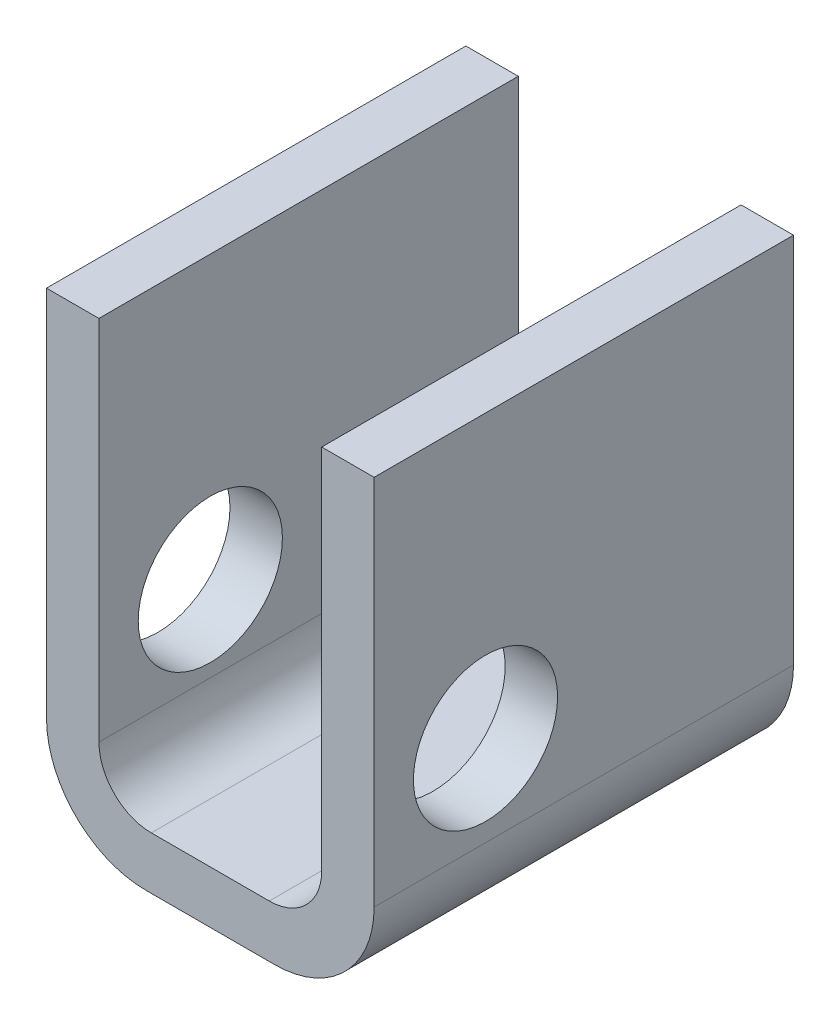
ISO-10303-21;
HEADER;
FILE_DESCRIPTION(('STEP AP214'),'2;1');
FILE_NAME('part.step','',(''),(''),'','','');
FILE_SCHEMA(('AUTOMOTIVE_DESIGN { 1 0 10303 214 1 1 1 1 }'));
ENDSEC;
DATA;
#1=APPLICATION_CONTEXT('core data for automotive mechanical design processes');
#2=APPLICATION_PROTOCOL_DEFINITION('international standard','automotive_design',2000,#1);
#3=PRODUCT_CONTEXT('',#1,'mechanical');
#4=PRODUCT('Part','Part','',(#3));
#5=PRODUCT_RELATED_PRODUCT_CATEGORY('part','',(#4));
#6=PRODUCT_DEFINITION_FORMATION('','',#4);
#7=PRODUCT_DEFINITION_CONTEXT('part definition',#1,'design');
#8=PRODUCT_DEFINITION('design','',#6,#7);
#9=PRODUCT_DEFINITION_SHAPE('','',#8);
#10=(LENGTH_UNIT() NAMED_UNIT(*) SI_UNIT(.MILLI.,.METRE.));
#11=(NAMED_UNIT(*) PLANE_ANGLE_UNIT() SI_UNIT($,.RADIAN.));
#12=(NAMED_UNIT(*) SI_UNIT($,.STERADIAN.) SOLID_ANGLE_UNIT());
#13=UNCERTAINTY_MEASURE_WITH_UNIT(LENGTH_MEASURE(1.E-05),#10,'distance_accuracy_value','');
#14=(GEOMETRIC_REPRESENTATION_CONTEXT(3) GLOBAL_UNCERTAINTY_ASSIGNED_CONTEXT((#13)) GLOBAL_UNIT_ASSIGNED_CONTEXT((#10,
#11,#12)) REPRESENTATION_CONTEXT('',''));
#15=CARTESIAN_POINT('',(0.,0.,0.));
#16=DIRECTION('',(0.,0.,1.));
#17=DIRECTION('',(1.,0.,0.));
#18=AXIS2_PLACEMENT_3D('',#15,#16,#17);
#19=CARTESIAN_POINT('',(238.514744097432,153.970613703,50.8));
#20=DIRECTION('',(0.,-1.,0.));
#21=DIRECTION('',(0.,0.,-1.));
#22=AXIS2_PLACEMENT_3D('',#19,#20,#21);
#23=PLANE('',#22);
#24=DIRECTION('',(-1.,0.,0.));
#25=VECTOR('',#24,1.);
#26=CARTESIAN_POINT('',(238.514744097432,153.970613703,0.));
#27=LINE('',#26,#25);
#28=CARTESIAN_POINT('',(244.864744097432,153.970613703,0.));
#29=VERTEX_POINT('',#28);
#30=CARTESIAN_POINT('',(238.514744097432,153.970613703,0.));
#31=VERTEX_POINT('',#30);
#32=EDGE_CURVE('E154',#29,#31,#27,.T.);
#33=ORIENTED_EDGE('',*,*,#32,.T.);
#34=DIRECTION('',(0.,0.,-1.));
#35=VECTOR('',#34,1.);
#36=CARTESIAN_POINT('',(238.514744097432,153.970613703,50.8));
#37=LINE('',#36,#35);
#38=CARTESIAN_POINT('',(238.514744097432,153.970613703,50.8));
#39=VERTEX_POINT('',#38);
#40=EDGE_CURVE('E11',#39,#31,#37,.T.);
#41=ORIENTED_EDGE('',*,*,#40,.F.);
#42=DIRECTION('',(-1.,0.,0.));
#43=VECTOR('',#42,1.);
#44=CARTESIAN_POINT('',(238.514744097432,153.970613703,50.8));
#45=LINE('',#44,#43);
#46=CARTESIAN_POINT('',(244.864744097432,153.970613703,50.8));
#47=VERTEX_POINT('',#46);
#48=EDGE_CURVE('E177',#47,#39,#45,.T.);
#49=ORIENTED_EDGE('',*,*,#48,.F.);
#50=DIRECTION('',(0.,0.,-1.));
#51=VECTOR('',#50,1.);
#52=CARTESIAN_POINT('',(244.864744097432,153.970613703,50.8));
#53=LINE('',#52,#51);
#54=EDGE_CURVE('E150',#47,#29,#53,.T.);
#55=ORIENTED_EDGE('',*,*,#54,.T.);
#56=EDGE_LOOP('',(#33,#41,#49,#55));
#57=FACE_BOUND('',#56,.T.);
#58=ADVANCED_FACE('F34',(#57),#23,.F.);
#59=CARTESIAN_POINT('',(238.514744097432,109.520613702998,50.8));
#60=DIRECTION('',(1.,0.,0.));
#61=DIRECTION('',(0.,0.,-1.));
#62=AXIS2_PLACEMENT_3D('',#59,#60,#61);
#63=PLANE('',#62);
#64=CARTESIAN_POINT('',(238.514744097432,119.839363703,37.30625));
#65=DIRECTION('',(1.,0.,0.));
#66=DIRECTION('',(0.,0.,-1.));
#67=AXIS2_PLACEMENT_3D('',#64,#65,#66);
#68=CIRCLE('',#67,8.73125);
#69=CARTESIAN_POINT('',(238.514744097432,119.839363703,28.575));
#70=VERTEX_POINT('',#69);
#71=EDGE_CURVE('E158',#70,#70,#68,.T.);
#72=ORIENTED_EDGE('',*,*,#71,.T.);
#73=EDGE_LOOP('',(#72));
#74=FACE_BOUND('',#73,.T.);
#75=DIRECTION('',(0.,-1.,0.));
#76=VECTOR('',#75,1.);
#77=CARTESIAN_POINT('',(238.514744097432,109.520613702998,0.));
#78=LINE('',#77,#76);
#79=CARTESIAN_POINT('',(238.514744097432,109.520613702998,0.));
#80=VERTEX_POINT('',#79);
#81=EDGE_CURVE('E157',#31,#80,#78,.T.);
#82=ORIENTED_EDGE('',*,*,#81,.T.);
#83=DIRECTION('',(0.,0.,-1.));
#84=VECTOR('',#83,1.);
#85=CARTESIAN_POINT('',(238.514744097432,109.520613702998,50.8));
#86=LINE('',#85,#84);
#87=CARTESIAN_POINT('',(238.514744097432,109.520613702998,50.8));
#88=VERTEX_POINT('',#87);
#89=EDGE_CURVE('E42',#88,#80,#86,.T.);
#90=ORIENTED_EDGE('',*,*,#89,.F.);
#91=DIRECTION('',(0.,-1.,0.));
#92=VECTOR('',#91,1.);
#93=CARTESIAN_POINT('',(238.514744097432,109.520613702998,50.8));
#94=LINE('',#93,#92);
#95=EDGE_CURVE('E105',#39,#88,#94,.T.);
#96=ORIENTED_EDGE('',*,*,#95,.F.);
#97=ORIENTED_EDGE('',*,*,#40,.T.);
#98=EDGE_LOOP('',(#82,#90,#96,#97));
#99=FACE_BOUND('',#98,.T.);
#100=ADVANCED_FACE('F257',(#74,#99),#63,.F.);
#101=CARTESIAN_POINT('',(232.164744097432,109.520613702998,50.8));
#102=DIRECTION('',(0.,0.,-1.));
#103=DIRECTION('',(-1.,0.,0.));
#104=AXIS2_PLACEMENT_3D('',#101,#102,#103);
#105=CYLINDRICAL_SURFACE('',#104,6.34999999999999);
#106=CARTESIAN_POINT('',(232.164744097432,109.520613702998,0.));
#107=DIRECTION('',(0.,0.,-1.));
#108=DIRECTION('',(1.,0.,0.));
#109=AXIS2_PLACEMENT_3D('',#106,#107,#108);
#110=CIRCLE('',#109,6.34999999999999);
#111=CARTESIAN_POINT('',(232.164744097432,103.170613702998,0.));
#112=VERTEX_POINT('',#111);
#113=EDGE_CURVE('E160',#80,#112,#110,.T.);
#114=ORIENTED_EDGE('',*,*,#113,.T.);
#115=DIRECTION('',(0.,0.,-1.));
#116=VECTOR('',#115,1.);
#117=CARTESIAN_POINT('',(232.164744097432,103.170613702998,50.8));
#118=LINE('',#117,#116);
#119=CARTESIAN_POINT('',(232.164744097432,103.170613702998,50.8));
#120=VERTEX_POINT('',#119);
#121=EDGE_CURVE('E196',#120,#112,#118,.T.);
#122=ORIENTED_EDGE('',*,*,#121,.F.);
#123=CARTESIAN_POINT('',(232.164744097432,109.520613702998,50.8));
#124=DIRECTION('',(0.,0.,-1.));
#125=DIRECTION('',(1.,0.,0.));
#126=AXIS2_PLACEMENT_3D('',#123,#124,#125);
#127=CIRCLE('',#126,6.34999999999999);
#128=EDGE_CURVE('E204',#88,#120,#127,.T.);
#129=ORIENTED_EDGE('',*,*,#128,.F.);
#130=ORIENTED_EDGE('',*,*,#89,.T.);
#131=EDGE_LOOP('',(#114,#122,#129,#130));
#132=FACE_BOUND('',#131,.T.);
#133=ADVANCED_FACE('F202',(#132),#105,.F.);
#134=CARTESIAN_POINT('',(217.877244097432,103.170613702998,50.8));
#135=DIRECTION('',(0.,-1.,0.));
#136=DIRECTION('',(0.,0.,-1.));
#137=AXIS2_PLACEMENT_3D('',#134,#135,#136);
#138=PLANE('',#137);
#139=DIRECTION('',(-1.,0.,0.));
#140=VECTOR('',#139,1.);
#141=CARTESIAN_POINT('',(217.877244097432,103.170613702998,0.));
#142=LINE('',#141,#140);
#143=CARTESIAN_POINT('',(217.877244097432,103.170613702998,0.));
#144=VERTEX_POINT('',#143);
#145=EDGE_CURVE('E162',#112,#144,#142,.T.);
#146=ORIENTED_EDGE('',*,*,#145,.T.);
#147=DIRECTION('',(0.,0.,-1.));
#148=VECTOR('',#147,1.);
#149=CARTESIAN_POINT('',(217.877244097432,103.170613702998,50.8));
#150=LINE('',#149,#148);
#151=CARTESIAN_POINT('',(217.877244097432,103.170613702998,50.8));
#152=VERTEX_POINT('',#151);
#153=EDGE_CURVE('E193',#152,#144,#150,.T.);
#154=ORIENTED_EDGE('',*,*,#153,.F.);
#155=DIRECTION('',(-1.,0.,0.));
#156=VECTOR('',#155,1.);
#157=CARTESIAN_POINT('',(217.877244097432,103.170613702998,50.8));
#158=LINE('',#157,#156);
#159=EDGE_CURVE('E222',#120,#152,#158,.T.);
#160=ORIENTED_EDGE('',*,*,#159,.F.);
#161=ORIENTED_EDGE('',*,*,#121,.T.);
#162=EDGE_LOOP('',(#146,#154,#160,#161));
#163=FACE_BOUND('',#162,.T.);
#164=ADVANCED_FACE('F213',(#163),#138,.F.);
#165=CARTESIAN_POINT('',(217.877244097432,109.520613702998,50.8));
#166=DIRECTION('',(0.,0.,-1.));
#167=DIRECTION('',(-1.,0.,0.));
#168=AXIS2_PLACEMENT_3D('',#165,#166,#167);
#169=CYLINDRICAL_SURFACE('',#168,6.34999999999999);
#170=CARTESIAN_POINT('',(217.877244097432,109.520613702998,0.));
#171=DIRECTION('',(0.,0.,-1.));
#172=DIRECTION('',(-1.,0.,0.));
#173=AXIS2_PLACEMENT_3D('',#170,#171,#172);
#174=CIRCLE('',#173,6.34999999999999);
#175=CARTESIAN_POINT('',(211.527244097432,109.520613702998,0.));
#176=VERTEX_POINT('',#175);
#177=EDGE_CURVE('E164',#144,#176,#174,.T.);
#178=ORIENTED_EDGE('',*,*,#177,.T.);
#179=DIRECTION('',(0.,0.,-1.));
#180=VECTOR('',#179,1.);
#181=CARTESIAN_POINT('',(211.527244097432,109.520613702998,50.8));
#182=LINE('',#181,#180);
#183=CARTESIAN_POINT('',(211.527244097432,109.520613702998,50.8));
#184=VERTEX_POINT('',#183);
#185=EDGE_CURVE('E190',#184,#176,#182,.T.);
#186=ORIENTED_EDGE('',*,*,#185,.F.);
#187=CARTESIAN_POINT('',(217.877244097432,109.520613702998,50.8));
#188=DIRECTION('',(0.,0.,-1.));
#189=DIRECTION('',(-1.,0.,0.));
#190=AXIS2_PLACEMENT_3D('',#187,#188,#189);
#191=CIRCLE('',#190,6.34999999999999);
#192=EDGE_CURVE('E219',#152,#184,#191,.T.);
#193=ORIENTED_EDGE('',*,*,#192,.F.);
#194=ORIENTED_EDGE('',*,*,#153,.T.);
#195=EDGE_LOOP('',(#178,#186,#193,#194));
#196=FACE_BOUND('',#195,.T.);
#197=ADVANCED_FACE('F217',(#196),#169,.F.);
#198=CARTESIAN_POINT('',(211.527244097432,153.970613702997,50.8));
#199=DIRECTION('',(-1.,0.,0.));
#200=DIRECTION('',(0.,0.,1.));
#201=AXIS2_PLACEMENT_3D('',#198,#199,#200);
#202=PLANE('',#201);
#203=CARTESIAN_POINT('',(211.527244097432,119.839363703,37.30625));
#204=DIRECTION('',(-1.,0.,0.));
#205=DIRECTION('',(0.,0.,1.));
#206=AXIS2_PLACEMENT_3D('',#203,#204,#205);
#207=CIRCLE('',#206,8.73125);
#208=CARTESIAN_POINT('',(211.527244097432,119.839363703,46.0375));
#209=VERTEX_POINT('',#208);
#210=EDGE_CURVE('E361',#209,#209,#207,.T.);
#211=ORIENTED_EDGE('',*,*,#210,.T.);
#212=EDGE_LOOP('',(#211));
#213=FACE_BOUND('',#212,.T.);
#214=DIRECTION('',(0.,1.,0.));
#215=VECTOR('',#214,1.);
#216=CARTESIAN_POINT('',(211.527244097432,153.970613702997,0.));
#217=LINE('',#216,#215);
#218=CARTESIAN_POINT('',(211.527244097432,153.970613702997,0.));
#219=VERTEX_POINT('',#218);
#220=EDGE_CURVE('E166',#176,#219,#217,.T.);
#221=ORIENTED_EDGE('',*,*,#220,.T.);
#222=DIRECTION('',(0.,0.,-1.));
#223=VECTOR('',#222,1.);
#224=CARTESIAN_POINT('',(211.527244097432,153.970613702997,50.8));
#225=LINE('',#224,#223);
#226=CARTESIAN_POINT('',(211.527244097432,153.970613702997,50.8));
#227=VERTEX_POINT('',#226);
#228=EDGE_CURVE('E187',#227,#219,#225,.T.);
#229=ORIENTED_EDGE('',*,*,#228,.F.);
#230=DIRECTION('',(0.,1.,0.));
#231=VECTOR('',#230,1.);
#232=CARTESIAN_POINT('',(211.527244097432,153.970613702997,50.8));
#233=LINE('',#232,#231);
#234=EDGE_CURVE('E221',#184,#227,#233,.T.);
#235=ORIENTED_EDGE('',*,*,#234,.F.);
#236=ORIENTED_EDGE('',*,*,#185,.T.);
#237=EDGE_LOOP('',(#221,#229,#235,#236));
#238=FACE_BOUND('',#237,.T.);
#239=ADVANCED_FACE('F272',(#213,#238),#202,.F.);
#240=CARTESIAN_POINT('',(205.177244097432,153.970613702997,50.8));
#241=DIRECTION('',(0.,-1.,0.));
#242=DIRECTION('',(0.,0.,-1.));
#243=AXIS2_PLACEMENT_3D('',#240,#241,#242);
#244=PLANE('',#243);
#245=DIRECTION('',(-1.,0.,0.));
#246=VECTOR('',#245,1.);
#247=CARTESIAN_POINT('',(205.177244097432,153.970613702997,0.));
#248=LINE('',#247,#246);
#249=CARTESIAN_POINT('',(205.177244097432,153.970613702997,0.));
#250=VERTEX_POINT('',#249);
#251=EDGE_CURVE('E168',#219,#250,#248,.T.);
#252=ORIENTED_EDGE('',*,*,#251,.T.);
#253=DIRECTION('',(0.,0.,-1.));
#254=VECTOR('',#253,1.);
#255=CARTESIAN_POINT('',(205.177244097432,153.970613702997,50.8));
#256=LINE('',#255,#254);
#257=CARTESIAN_POINT('',(205.177244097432,153.970613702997,50.8));
#258=VERTEX_POINT('',#257);
#259=EDGE_CURVE('E184',#258,#250,#256,.T.);
#260=ORIENTED_EDGE('',*,*,#259,.F.);
#261=DIRECTION('',(-1.,0.,0.));
#262=VECTOR('',#261,1.);
#263=CARTESIAN_POINT('',(205.177244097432,153.970613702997,50.8));
#264=LINE('',#263,#262);
#265=EDGE_CURVE('E224',#227,#258,#264,.T.);
#266=ORIENTED_EDGE('',*,*,#265,.F.);
#267=ORIENTED_EDGE('',*,*,#228,.T.);
#268=EDGE_LOOP('',(#252,#260,#266,#267));
#269=FACE_BOUND('',#268,.T.);
#270=ADVANCED_FACE('F275',(#269),#244,.F.);
#271=CARTESIAN_POINT('',(205.177244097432,108.888153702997,50.8));
#272=DIRECTION('',(1.,0.,0.));
#273=DIRECTION('',(0.,0.,-1.));
#274=AXIS2_PLACEMENT_3D('',#271,#272,#273);
#275=PLANE('',#274);
#276=CARTESIAN_POINT('',(205.177244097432,119.839363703,37.30625));
#277=DIRECTION('',(1.,0.,0.));
#278=DIRECTION('',(0.,0.,-1.));
#279=AXIS2_PLACEMENT_3D('',#276,#277,#278);
#280=CIRCLE('',#279,8.73125);
#281=CARTESIAN_POINT('',(205.177244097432,119.839363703,28.575));
#282=VERTEX_POINT('',#281);
#283=EDGE_CURVE('E358',#282,#282,#280,.T.);
#284=ORIENTED_EDGE('',*,*,#283,.T.);
#285=EDGE_LOOP('',(#284));
#286=FACE_BOUND('',#285,.T.);
#287=DIRECTION('',(0.,-1.,0.));
#288=VECTOR('',#287,1.);
#289=CARTESIAN_POINT('',(205.177244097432,108.888153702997,0.));
#290=LINE('',#289,#288);
#291=CARTESIAN_POINT('',(205.177244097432,108.888153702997,0.));
#292=VERTEX_POINT('',#291);
#293=EDGE_CURVE('E170',#250,#292,#290,.T.);
#294=ORIENTED_EDGE('',*,*,#293,.T.);
#295=DIRECTION('',(0.,0.,-1.));
#296=VECTOR('',#295,1.);
#297=CARTESIAN_POINT('',(205.177244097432,108.888153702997,50.8));
#298=LINE('',#297,#296);
#299=CARTESIAN_POINT('',(205.177244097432,108.888153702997,50.8));
#300=VERTEX_POINT('',#299);
#301=EDGE_CURVE('E181',#300,#292,#298,.T.);
#302=ORIENTED_EDGE('',*,*,#301,.F.);
#303=DIRECTION('',(0.,-1.,0.));
#304=VECTOR('',#303,1.);
#305=CARTESIAN_POINT('',(205.177244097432,108.888153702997,50.8));
#306=LINE('',#305,#304);
#307=EDGE_CURVE('E230',#258,#300,#306,.T.);
#308=ORIENTED_EDGE('',*,*,#307,.F.);
#309=ORIENTED_EDGE('',*,*,#259,.T.);
#310=EDGE_LOOP('',(#294,#302,#308,#309));
#311=FACE_BOUND('',#310,.T.);
#312=ADVANCED_FACE('F236',(#286,#311),#275,.F.);
#313=CARTESIAN_POINT('',(217.244784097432,108.888153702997,50.8));
#314=DIRECTION('',(0.,0.,-1.));
#315=DIRECTION('',(-1.,0.,0.));
#316=AXIS2_PLACEMENT_3D('',#313,#314,#315);
#317=CYLINDRICAL_SURFACE('',#316,12.06754);
#318=CARTESIAN_POINT('',(217.244784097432,108.888153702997,0.));
#319=DIRECTION('',(0.,0.,1.));
#320=DIRECTION('',(-1.,0.,0.));
#321=AXIS2_PLACEMENT_3D('',#318,#319,#320);
#322=CIRCLE('',#321,12.06754);
#323=CARTESIAN_POINT('',(217.244784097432,96.8206137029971,0.));
#324=VERTEX_POINT('',#323);
#325=EDGE_CURVE('E172',#292,#324,#322,.T.);
#326=ORIENTED_EDGE('',*,*,#325,.T.);
#327=DIRECTION('',(0.,0.,-1.));
#328=VECTOR('',#327,1.);
#329=CARTESIAN_POINT('',(217.244784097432,96.8206137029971,50.8));
#330=LINE('',#329,#328);
#331=CARTESIAN_POINT('',(217.244784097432,96.8206137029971,50.8));
#332=VERTEX_POINT('',#331);
#333=EDGE_CURVE('E145',#332,#324,#330,.T.);
#334=ORIENTED_EDGE('',*,*,#333,.F.);
#335=CARTESIAN_POINT('',(217.244784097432,108.888153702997,50.8));
#336=DIRECTION('',(0.,0.,1.));
#337=DIRECTION('',(-1.,0.,0.));
#338=AXIS2_PLACEMENT_3D('',#335,#336,#337);
#339=CIRCLE('',#338,12.06754);
#340=EDGE_CURVE('E136',#300,#332,#339,.T.);
#341=ORIENTED_EDGE('',*,*,#340,.F.);
#342=ORIENTED_EDGE('',*,*,#301,.T.);
#343=EDGE_LOOP('',(#326,#334,#341,#342));
#344=FACE_BOUND('',#343,.T.);
#345=ADVANCED_FACE('F240',(#344),#317,.T.);
#346=CARTESIAN_POINT('',(217.244784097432,96.8206137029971,50.8));
#347=DIRECTION('',(0.,1.,0.));
#348=DIRECTION('',(0.,0.,1.));
#349=AXIS2_PLACEMENT_3D('',#346,#347,#348);
#350=PLANE('',#349);
#351=DIRECTION('',(1.,0.,0.));
#352=VECTOR('',#351,1.);
#353=CARTESIAN_POINT('',(217.244784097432,96.8206137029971,0.));
#354=LINE('',#353,#352);
#355=CARTESIAN_POINT('',(232.797204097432,96.8206137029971,0.));
#356=VERTEX_POINT('',#355);
#357=EDGE_CURVE('E144',#324,#356,#354,.T.);
#358=ORIENTED_EDGE('',*,*,#357,.T.);
#359=DIRECTION('',(0.,0.,-1.));
#360=VECTOR('',#359,1.);
#361=CARTESIAN_POINT('',(232.797204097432,96.8206137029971,50.8));
#362=LINE('',#361,#360);
#363=CARTESIAN_POINT('',(232.797204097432,96.8206137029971,50.8));
#364=VERTEX_POINT('',#363);
#365=EDGE_CURVE('E141',#364,#356,#362,.T.);
#366=ORIENTED_EDGE('',*,*,#365,.F.);
#367=DIRECTION('',(1.,0.,0.));
#368=VECTOR('',#367,1.);
#369=CARTESIAN_POINT('',(217.244784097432,96.8206137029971,50.8));
#370=LINE('',#369,#368);
#371=EDGE_CURVE('E130',#332,#364,#370,.T.);
#372=ORIENTED_EDGE('',*,*,#371,.F.);
#373=ORIENTED_EDGE('',*,*,#333,.T.);
#374=EDGE_LOOP('',(#358,#366,#372,#373));
#375=FACE_BOUND('',#374,.T.);
#376=ADVANCED_FACE('F142',(#375),#350,.F.);
#377=CARTESIAN_POINT('',(232.797204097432,108.888153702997,50.8));
#378=DIRECTION('',(0.,0.,-1.));
#379=DIRECTION('',(-1.,0.,0.));
#380=AXIS2_PLACEMENT_3D('',#377,#378,#379);
#381=CYLINDRICAL_SURFACE('',#380,12.06754);
#382=CARTESIAN_POINT('',(232.797204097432,108.888153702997,0.));
#383=DIRECTION('',(0.,0.,1.));
#384=DIRECTION('',(1.,0.,0.));
#385=AXIS2_PLACEMENT_3D('',#382,#383,#384);
#386=CIRCLE('',#385,12.06754);
#387=CARTESIAN_POINT('',(244.864744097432,108.888153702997,0.));
#388=VERTEX_POINT('',#387);
#389=EDGE_CURVE('E91',#356,#388,#386,.T.);
#390=ORIENTED_EDGE('',*,*,#389,.T.);
#391=DIRECTION('',(0.,0.,-1.));
#392=VECTOR('',#391,1.);
#393=CARTESIAN_POINT('',(244.864744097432,108.888153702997,50.8));
#394=LINE('',#393,#392);
#395=CARTESIAN_POINT('',(244.864744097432,108.888153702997,50.8));
#396=VERTEX_POINT('',#395);
#397=EDGE_CURVE('E146',#396,#388,#394,.T.);
#398=ORIENTED_EDGE('',*,*,#397,.F.);
#399=CARTESIAN_POINT('',(232.797204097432,108.888153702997,50.8));
#400=DIRECTION('',(0.,0.,1.));
#401=DIRECTION('',(1.,0.,0.));
#402=AXIS2_PLACEMENT_3D('',#399,#400,#401);
#403=CIRCLE('',#402,12.06754);
#404=EDGE_CURVE('E134',#364,#396,#403,.T.);
#405=ORIENTED_EDGE('',*,*,#404,.F.);
#406=ORIENTED_EDGE('',*,*,#365,.T.);
#407=EDGE_LOOP('',(#390,#398,#405,#406));
#408=FACE_BOUND('',#407,.T.);
#409=ADVANCED_FACE('F148',(#408),#381,.T.);
#410=CARTESIAN_POINT('',(244.864744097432,108.888153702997,50.8));
#411=DIRECTION('',(-1.,0.,0.));
#412=DIRECTION('',(0.,0.,1.));
#413=AXIS2_PLACEMENT_3D('',#410,#411,#412);
#414=PLANE('',#413);
#415=CARTESIAN_POINT('',(244.864744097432,119.839363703,37.30625));
#416=DIRECTION('',(1.,0.,0.));
#417=DIRECTION('',(0.,0.,-1.));
#418=AXIS2_PLACEMENT_3D('',#415,#416,#417);
#419=CIRCLE('',#418,8.73125);
#420=CARTESIAN_POINT('',(244.864744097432,119.839363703,28.575));
#421=VERTEX_POINT('',#420);
#422=EDGE_CURVE('E364',#421,#421,#419,.T.);
#423=ORIENTED_EDGE('',*,*,#422,.F.);
#424=EDGE_LOOP('',(#423));
#425=FACE_BOUND('',#424,.T.);
#426=DIRECTION('',(0.,1.,0.));
#427=VECTOR('',#426,1.);
#428=CARTESIAN_POINT('',(244.864744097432,108.888153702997,0.));
#429=LINE('',#428,#427);
#430=EDGE_CURVE('E97',#388,#29,#429,.T.);
#431=ORIENTED_EDGE('',*,*,#430,.T.);
#432=ORIENTED_EDGE('',*,*,#54,.F.);
#433=DIRECTION('',(0.,1.,0.));
#434=VECTOR('',#433,1.);
#435=CARTESIAN_POINT('',(244.864744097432,108.888153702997,50.8));
#436=LINE('',#435,#434);
#437=EDGE_CURVE('E50',#396,#47,#436,.T.);
#438=ORIENTED_EDGE('',*,*,#437,.F.);
#439=ORIENTED_EDGE('',*,*,#397,.T.);
#440=EDGE_LOOP('',(#431,#432,#438,#439));
#441=FACE_BOUND('',#440,.T.);
#442=ADVANCED_FACE('F244',(#425,#441),#414,.F.);
#443=CARTESIAN_POINT('',(232.797204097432,108.888153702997,50.8));
#444=DIRECTION('',(0.,0.,1.));
#445=DIRECTION('',(1.,0.,0.));
#446=AXIS2_PLACEMENT_3D('',#443,#444,#445);
#447=PLANE('',#446);
#448=ORIENTED_EDGE('',*,*,#48,.T.);
#449=ORIENTED_EDGE('',*,*,#95,.T.);
#450=ORIENTED_EDGE('',*,*,#128,.T.);
#451=ORIENTED_EDGE('',*,*,#159,.T.);
#452=ORIENTED_EDGE('',*,*,#192,.T.);
#453=ORIENTED_EDGE('',*,*,#234,.T.);
#454=ORIENTED_EDGE('',*,*,#265,.T.);
#455=ORIENTED_EDGE('',*,*,#307,.T.);
#456=ORIENTED_EDGE('',*,*,#340,.T.);
#457=ORIENTED_EDGE('',*,*,#371,.T.);
#458=ORIENTED_EDGE('',*,*,#404,.T.);
#459=ORIENTED_EDGE('',*,*,#437,.T.);
#460=EDGE_LOOP('',(#448,#449,#450,#451,#452,#453,#454,#455,#456,#457,#458,#459));
#461=FACE_BOUND('',#460,.T.);
#462=ADVANCED_FACE('F132',(#461),#447,.T.);
#463=CARTESIAN_POINT('',(232.797204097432,108.888153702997,0.));
#464=DIRECTION('',(0.,0.,1.));
#465=DIRECTION('',(1.,0.,0.));
#466=AXIS2_PLACEMENT_3D('',#463,#464,#465);
#467=PLANE('',#466);
#468=ORIENTED_EDGE('',*,*,#32,.F.);
#469=ORIENTED_EDGE('',*,*,#430,.F.);
#470=ORIENTED_EDGE('',*,*,#389,.F.);
#471=ORIENTED_EDGE('',*,*,#357,.F.);
#472=ORIENTED_EDGE('',*,*,#325,.F.);
#473=ORIENTED_EDGE('',*,*,#293,.F.);
#474=ORIENTED_EDGE('',*,*,#251,.F.);
#475=ORIENTED_EDGE('',*,*,#220,.F.);
#476=ORIENTED_EDGE('',*,*,#177,.F.);
#477=ORIENTED_EDGE('',*,*,#145,.F.);
#478=ORIENTED_EDGE('',*,*,#113,.F.);
#479=ORIENTED_EDGE('',*,*,#81,.F.);
#480=EDGE_LOOP('',(#468,#469,#470,#471,#472,#473,#474,#475,#476,#477,#478,#479));
#481=FACE_BOUND('',#480,.T.);
#482=ADVANCED_FACE('F208',(#481),#467,.F.);
#483=CARTESIAN_POINT('',(205.177244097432,119.839363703,37.30625));
#484=DIRECTION('',(1.,0.,0.));
#485=DIRECTION('',(0.,0.,-1.));
#486=AXIS2_PLACEMENT_3D('',#483,#484,#485);
#487=CYLINDRICAL_SURFACE('',#486,8.73125);
#488=ORIENTED_EDGE('',*,*,#422,.T.);
#489=EDGE_LOOP('',(#488));
#490=FACE_BOUND('',#489,.T.);
#491=ORIENTED_EDGE('',*,*,#71,.F.);
#492=EDGE_LOOP('',(#491));
#493=FACE_BOUND('',#492,.T.);
#494=ADVANCED_FACE('F309',(#490,#493),#487,.F.);
#495=ORIENTED_EDGE('',*,*,#283,.F.);
#496=EDGE_LOOP('',(#495));
#497=FACE_BOUND('',#496,.T.);
#498=ORIENTED_EDGE('',*,*,#210,.F.);
#499=EDGE_LOOP('',(#498));
#500=FACE_BOUND('',#499,.T.);
#501=ADVANCED_FACE('F342',(#497,#500),#487,.F.);
#502=CLOSED_SHELL('',(#58,#100,#133,#164,#197,#239,#270,#312,#345,#376,#409,#442,#462,#482,#494,#501));
#503=MANIFOLD_SOLID_BREP('B2',#502);
#504=ADVANCED_BREP_SHAPE_REPRESENTATION('',(#18,#503),#14);
#505=SHAPE_DEFINITION_REPRESENTATION(#9,#504);
ENDSEC;
END-ISO-10303-21;
